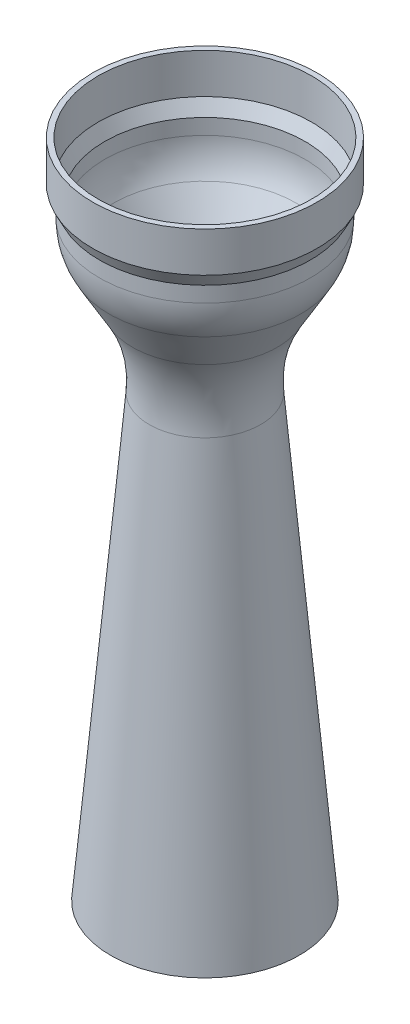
ISO-10303-21;
HEADER;
FILE_DESCRIPTION(('STEP AP214'),'2;1');
FILE_NAME('part.step','',(''),(''),'','','');
FILE_SCHEMA(('AUTOMOTIVE_DESIGN { 1 0 10303 214 1 1 1 1 }'));
ENDSEC;
DATA;
#1=APPLICATION_CONTEXT('core data for automotive mechanical design processes');
#2=APPLICATION_PROTOCOL_DEFINITION('international standard','automotive_design',2000,#1);
#3=PRODUCT_CONTEXT('',#1,'mechanical');
#4=PRODUCT('Part','Part','',(#3));
#5=PRODUCT_RELATED_PRODUCT_CATEGORY('part','',(#4));
#6=PRODUCT_DEFINITION_FORMATION('','',#4);
#7=PRODUCT_DEFINITION_CONTEXT('part definition',#1,'design');
#8=PRODUCT_DEFINITION('design','',#6,#7);
#9=PRODUCT_DEFINITION_SHAPE('','',#8);
#10=(LENGTH_UNIT() NAMED_UNIT(*) SI_UNIT(.MILLI.,.METRE.));
#11=(NAMED_UNIT(*) PLANE_ANGLE_UNIT() SI_UNIT($,.RADIAN.));
#12=(NAMED_UNIT(*) SI_UNIT($,.STERADIAN.) SOLID_ANGLE_UNIT());
#13=UNCERTAINTY_MEASURE_WITH_UNIT(LENGTH_MEASURE(1.E-05),#10,'distance_accuracy_value','');
#14=(GEOMETRIC_REPRESENTATION_CONTEXT(3) GLOBAL_UNCERTAINTY_ASSIGNED_CONTEXT((#13)) GLOBAL_UNIT_ASSIGNED_CONTEXT((#10,
#11,#12)) REPRESENTATION_CONTEXT('',''));
#15=CARTESIAN_POINT('',(0.,0.,0.));
#16=DIRECTION('',(0.,0.,1.));
#17=DIRECTION('',(1.,0.,0.));
#18=AXIS2_PLACEMENT_3D('',#15,#16,#17);
#19=CARTESIAN_POINT('',(0.,2.54000015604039,0.));
#20=DIRECTION('',(0.,1.,0.));
#21=DIRECTION('',(-1.,0.,0.));
#22=AXIS2_PLACEMENT_3D('',#19,#20,#21);
#23=CONICAL_SURFACE('',#22,20.32,0.463647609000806);
#24=CARTESIAN_POINT('',(0.,1.56040388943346E-07,0.));
#25=DIRECTION('',(0.,1.,0.));
#26=DIRECTION('',(-1.,0.,0.));
#27=AXIS2_PLACEMENT_3D('',#24,#25,#26);
#28=CIRCLE('',#27,19.05);
#29=CARTESIAN_POINT('',(-19.05,1.56040386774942E-07,0.));
#30=VERTEX_POINT('',#29);
#31=EDGE_CURVE('E88',#30,#30,#28,.T.);
#32=ORIENTED_EDGE('',*,*,#31,.F.);
#33=EDGE_LOOP('',(#32));
#34=FACE_BOUND('',#33,.T.);
#35=CARTESIAN_POINT('',(0.,2.54000015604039,0.));
#36=DIRECTION('',(0.,1.,0.));
#37=DIRECTION('',(-1.,0.,0.));
#38=AXIS2_PLACEMENT_3D('',#35,#36,#37);
#39=CIRCLE('',#38,20.32);
#40=CARTESIAN_POINT('',(-20.32,2.54000015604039,0.));
#41=VERTEX_POINT('',#40);
#42=EDGE_CURVE('E10',#41,#41,#39,.T.);
#43=ORIENTED_EDGE('',*,*,#42,.T.);
#44=EDGE_LOOP('',(#43));
#45=FACE_BOUND('',#44,.T.);
#46=ADVANCED_FACE('F36',(#34,#45),#23,.F.);
#47=CARTESIAN_POINT('',(0.,0.,0.));
#48=DIRECTION('',(0.,1.,0.));
#49=DIRECTION('',(-1.,0.,0.));
#50=AXIS2_PLACEMENT_3D('',#47,#48,#49);
#51=CYLINDRICAL_SURFACE('',#50,20.32);
#52=ORIENTED_EDGE('',*,*,#42,.F.);
#53=EDGE_LOOP('',(#52));
#54=FACE_BOUND('',#53,.T.);
#55=CARTESIAN_POINT('',(0.,10.1600001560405,0.));
#56=DIRECTION('',(0.,1.,0.));
#57=DIRECTION('',(-1.,0.,0.));
#58=AXIS2_PLACEMENT_3D('',#55,#56,#57);
#59=CIRCLE('',#58,20.32);
#60=CARTESIAN_POINT('',(-20.32,10.1600001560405,0.));
#61=VERTEX_POINT('',#60);
#62=EDGE_CURVE('E42',#61,#61,#59,.T.);
#63=ORIENTED_EDGE('',*,*,#62,.T.);
#64=EDGE_LOOP('',(#63));
#65=FACE_BOUND('',#64,.T.);
#66=ADVANCED_FACE('F95',(#54,#65),#51,.F.);
#67=CARTESIAN_POINT('',(20.32,10.1600001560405,0.));
#68=DIRECTION('',(0.,-1.,0.));
#69=DIRECTION('',(1.,0.,0.));
#70=AXIS2_PLACEMENT_3D('',#67,#68,#69);
#71=PLANE('',#70);
#72=ORIENTED_EDGE('',*,*,#62,.F.);
#73=EDGE_LOOP('',(#72));
#74=FACE_BOUND('',#73,.T.);
#75=CARTESIAN_POINT('',(0.,10.1600001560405,0.));
#76=DIRECTION('',(0.,1.,0.));
#77=DIRECTION('',(-1.,0.,0.));
#78=AXIS2_PLACEMENT_3D('',#75,#76,#77);
#79=CIRCLE('',#78,21.336);
#80=CARTESIAN_POINT('',(-21.336,10.1600001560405,0.));
#81=VERTEX_POINT('',#80);
#82=EDGE_CURVE('E46',#81,#81,#79,.T.);
#83=ORIENTED_EDGE('',*,*,#82,.T.);
#84=EDGE_LOOP('',(#83));
#85=FACE_BOUND('',#84,.T.);
#86=ADVANCED_FACE('F99',(#74,#85),#71,.F.);
#87=CARTESIAN_POINT('',(0.,0.,0.));
#88=DIRECTION('',(0.,1.,0.));
#89=DIRECTION('',(-1.,0.,0.));
#90=AXIS2_PLACEMENT_3D('',#87,#88,#89);
#91=CYLINDRICAL_SURFACE('',#90,21.336);
#92=ORIENTED_EDGE('',*,*,#82,.F.);
#93=EDGE_LOOP('',(#92));
#94=FACE_BOUND('',#93,.T.);
#95=CARTESIAN_POINT('',(0.,2.54,0.));
#96=DIRECTION('',(0.,1.,0.));
#97=DIRECTION('',(-1.,0.,0.));
#98=AXIS2_PLACEMENT_3D('',#95,#96,#97);
#99=CIRCLE('',#98,21.336);
#100=CARTESIAN_POINT('',(-21.336,2.54,0.));
#101=VERTEX_POINT('',#100);
#102=EDGE_CURVE('E50',#101,#101,#99,.T.);
#103=ORIENTED_EDGE('',*,*,#102,.T.);
#104=EDGE_LOOP('',(#103));
#105=FACE_BOUND('',#104,.T.);
#106=ADVANCED_FACE('F104',(#94,#105),#91,.T.);
#107=CARTESIAN_POINT('',(0.,0.,0.));
#108=DIRECTION('',(0.,1.,0.));
#109=DIRECTION('',(-1.,0.,0.));
#110=AXIS2_PLACEMENT_3D('',#107,#108,#109);
#111=CONICAL_SURFACE('',#110,20.066,0.463647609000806);
#112=ORIENTED_EDGE('',*,*,#102,.F.);
#113=EDGE_LOOP('',(#112));
#114=FACE_BOUND('',#113,.T.);
#115=CARTESIAN_POINT('',(0.,0.,0.));
#116=DIRECTION('',(0.,1.,0.));
#117=DIRECTION('',(-1.,0.,0.));
#118=AXIS2_PLACEMENT_3D('',#115,#116,#117);
#119=CIRCLE('',#118,20.066);
#120=CARTESIAN_POINT('',(-20.066,0.,0.));
#121=VERTEX_POINT('',#120);
#122=EDGE_CURVE('E55',#121,#121,#119,.T.);
#123=ORIENTED_EDGE('',*,*,#122,.T.);
#124=EDGE_LOOP('',(#123));
#125=FACE_BOUND('',#124,.T.);
#126=ADVANCED_FACE('F110',(#114,#125),#111,.T.);
#127=CARTESIAN_POINT('',(0.,0.,0.));
#128=DIRECTION('',(0.,1.,0.));
#129=DIRECTION('',(-1.,0.,0.));
#130=AXIS2_PLACEMENT_3D('',#127,#128,#129);
#131=CYLINDRICAL_SURFACE('',#130,20.066);
#132=ORIENTED_EDGE('',*,*,#122,.F.);
#133=EDGE_LOOP('',(#132));
#134=FACE_BOUND('',#133,.T.);
#135=CARTESIAN_POINT('',(0.,-2.94704541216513,0.));
#136=DIRECTION('',(0.,1.,0.));
#137=DIRECTION('',(-1.,0.,0.));
#138=AXIS2_PLACEMENT_3D('',#135,#136,#137);
#139=CIRCLE('',#138,20.066);
#140=CARTESIAN_POINT('',(-20.066,-2.94704541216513,0.));
#141=VERTEX_POINT('',#140);
#142=EDGE_CURVE('E58',#141,#141,#139,.T.);
#143=ORIENTED_EDGE('',*,*,#142,.T.);
#144=EDGE_LOOP('',(#143));
#145=FACE_BOUND('',#144,.T.);
#146=ADVANCED_FACE('F114',(#134,#145),#131,.T.);
#147=CARTESIAN_POINT('',(0.,-2.94704525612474,0.));
#148=DIRECTION('',(0.,1.,0.));
#149=DIRECTION('',(-1.,0.,0.));
#150=AXIS2_PLACEMENT_3D('',#147,#148,#149);
#151=DEGENERATE_TOROIDAL_SURFACE('',#150,6.35,13.716,.T.);
#152=ORIENTED_EDGE('',*,*,#142,.F.);
#153=EDGE_LOOP('',(#152));
#154=FACE_BOUND('',#153,.T.);
#155=CARTESIAN_POINT('',(0.,-9.80504498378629,0.));
#156=DIRECTION('',(0.,1.,0.));
#157=DIRECTION('',(-1.,0.,0.));
#158=AXIS2_PLACEMENT_3D('',#155,#156,#157);
#159=CIRCLE('',#158,18.228404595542);
#160=CARTESIAN_POINT('',(-18.228404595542,-9.80504498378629,0.));
#161=VERTEX_POINT('',#160);
#162=EDGE_CURVE('E61',#161,#161,#159,.T.);
#163=ORIENTED_EDGE('',*,*,#162,.T.);
#164=EDGE_LOOP('',(#163));
#165=FACE_BOUND('',#164,.T.);
#166=ADVANCED_FACE('F118',(#154,#165),#151,.T.);
#167=CARTESIAN_POINT('',(0.,-17.5056884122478,0.));
#168=DIRECTION('',(0.,1.,0.));
#169=DIRECTION('',(-1.,0.,0.));
#170=AXIS2_PLACEMENT_3D('',#167,#168,#169);
#171=CONICAL_SURFACE('',#170,13.7824362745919,0.523598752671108);
#172=ORIENTED_EDGE('',*,*,#162,.F.);
#173=EDGE_LOOP('',(#172));
#174=FACE_BOUND('',#173,.T.);
#175=CARTESIAN_POINT('',(0.,-17.5056884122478,0.));
#176=DIRECTION('',(0.,1.,0.));
#177=DIRECTION('',(-1.,0.,0.));
#178=AXIS2_PLACEMENT_3D('',#175,#176,#177);
#179=CIRCLE('',#178,13.7824362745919);
#180=CARTESIAN_POINT('',(-13.7824362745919,-17.5056884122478,0.));
#181=VERTEX_POINT('',#180);
#182=EDGE_CURVE('E64',#181,#181,#179,.T.);
#183=ORIENTED_EDGE('',*,*,#182,.T.);
#184=EDGE_LOOP('',(#183));
#185=FACE_BOUND('',#184,.T.);
#186=ADVANCED_FACE('F122',(#174,#185),#171,.T.);
#187=CARTESIAN_POINT('',(0.,-29.6976879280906,0.));
#188=DIRECTION('',(0.,1.,0.));
#189=DIRECTION('',(-1.,0.,0.));
#190=AXIS2_PLACEMENT_3D('',#187,#188,#189);
#191=TOROIDAL_SURFACE('',#190,34.8996,24.384);
#192=ORIENTED_EDGE('',*,*,#182,.F.);
#193=EDGE_LOOP('',(#192));
#194=FACE_BOUND('',#193,.T.);
#195=CARTESIAN_POINT('',(0.,-31.8228935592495,0.));
#196=DIRECTION('',(0.,1.,0.));
#197=DIRECTION('',(-1.,0.,0.));
#198=AXIS2_PLACEMENT_3D('',#195,#196,#197);
#199=CIRCLE('',#198,10.6083884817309);
#200=CARTESIAN_POINT('',(-10.6083884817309,-31.8228935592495,0.));
#201=VERTEX_POINT('',#200);
#202=EDGE_CURVE('E67',#201,#201,#199,.T.);
#203=ORIENTED_EDGE('',*,*,#202,.T.);
#204=EDGE_LOOP('',(#203));
#205=FACE_BOUND('',#204,.T.);
#206=ADVANCED_FACE('F126',(#194,#205),#191,.F.);
#207=CARTESIAN_POINT('',(0.,-115.60025556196,0.));
#208=DIRECTION('',(0.,-1.,0.));
#209=DIRECTION('',(1.,0.,0.));
#210=AXIS2_PLACEMENT_3D('',#207,#208,#209);
#211=CONICAL_SURFACE('',#210,17.9379579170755,0.0872664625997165);
#212=ORIENTED_EDGE('',*,*,#202,.F.);
#213=EDGE_LOOP('',(#212));
#214=FACE_BOUND('',#213,.T.);
#215=CARTESIAN_POINT('',(0.,-115.60025556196,0.));
#216=DIRECTION('',(0.,1.,0.));
#217=DIRECTION('',(-1.,0.,0.));
#218=AXIS2_PLACEMENT_3D('',#215,#216,#217);
#219=CIRCLE('',#218,17.9379579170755);
#220=CARTESIAN_POINT('',(-17.9379579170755,-115.60025556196,0.));
#221=VERTEX_POINT('',#220);
#222=EDGE_CURVE('E70',#221,#221,#219,.T.);
#223=ORIENTED_EDGE('',*,*,#222,.T.);
#224=EDGE_LOOP('',(#223));
#225=FACE_BOUND('',#224,.T.);
#226=ADVANCED_FACE('F130',(#214,#225),#211,.T.);
#227=CARTESIAN_POINT('',(17.9379579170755,-115.60025556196,0.));
#228=DIRECTION('',(0.,1.,0.));
#229=DIRECTION('',(-1.,0.,0.));
#230=AXIS2_PLACEMENT_3D('',#227,#228,#229);
#231=PLANE('',#230);
#232=ORIENTED_EDGE('',*,*,#222,.F.);
#233=EDGE_LOOP('',(#232));
#234=FACE_BOUND('',#233,.T.);
#235=CARTESIAN_POINT('',(0.,-115.60025556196,0.));
#236=DIRECTION('',(0.,1.,0.));
#237=DIRECTION('',(-1.,0.,0.));
#238=AXIS2_PLACEMENT_3D('',#235,#236,#237);
#239=CIRCLE('',#238,16.9180769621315);
#240=CARTESIAN_POINT('',(-16.9180769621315,-115.60025556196,0.));
#241=VERTEX_POINT('',#240);
#242=EDGE_CURVE('E73',#241,#241,#239,.T.);
#243=ORIENTED_EDGE('',*,*,#242,.T.);
#244=EDGE_LOOP('',(#243));
#245=FACE_BOUND('',#244,.T.);
#246=ADVANCED_FACE('F134',(#234,#245),#231,.F.);
#247=CARTESIAN_POINT('',(0.,-31.9114437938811,0.));
#248=DIRECTION('',(0.,-1.,0.));
#249=DIRECTION('',(1.,0.,0.));
#250=AXIS2_PLACEMENT_3D('',#247,#248,#249);
#251=CONICAL_SURFACE('',#250,9.59625466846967,0.0872664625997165);
#252=ORIENTED_EDGE('',*,*,#242,.F.);
#253=EDGE_LOOP('',(#252));
#254=FACE_BOUND('',#253,.T.);
#255=CARTESIAN_POINT('',(0.,-31.9114437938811,0.));
#256=DIRECTION('',(0.,1.,0.));
#257=DIRECTION('',(-1.,0.,0.));
#258=AXIS2_PLACEMENT_3D('',#255,#256,#257);
#259=CIRCLE('',#258,9.59625466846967);
#260=CARTESIAN_POINT('',(-9.59625466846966,-31.9114437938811,0.));
#261=VERTEX_POINT('',#260);
#262=EDGE_CURVE('E76',#261,#261,#259,.T.);
#263=ORIENTED_EDGE('',*,*,#262,.T.);
#264=EDGE_LOOP('',(#263));
#265=FACE_BOUND('',#264,.T.);
#266=ADVANCED_FACE('F138',(#254,#265),#251,.F.);
#267=CARTESIAN_POINT('',(0.,-29.6976879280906,0.));
#268=DIRECTION('',(0.,1.,0.));
#269=DIRECTION('',(-1.,0.,0.));
#270=AXIS2_PLACEMENT_3D('',#267,#268,#269);
#271=TOROIDAL_SURFACE('',#270,34.8996,25.4);
#272=ORIENTED_EDGE('',*,*,#262,.F.);
#273=EDGE_LOOP('',(#272));
#274=FACE_BOUND('',#273,.T.);
#275=CARTESIAN_POINT('',(0.,-16.9976884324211,0.));
#276=DIRECTION('',(0.,1.,0.));
#277=DIRECTION('',(-1.,0.,0.));
#278=AXIS2_PLACEMENT_3D('',#275,#276,#277);
#279=CIRCLE('',#278,12.9025544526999);
#280=CARTESIAN_POINT('',(-12.9025544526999,-16.9976884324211,0.));
#281=VERTEX_POINT('',#280);
#282=EDGE_CURVE('E79',#281,#281,#279,.T.);
#283=ORIENTED_EDGE('',*,*,#282,.T.);
#284=EDGE_LOOP('',(#283));
#285=FACE_BOUND('',#284,.T.);
#286=ADVANCED_FACE('F142',(#274,#285),#271,.T.);
#287=CARTESIAN_POINT('',(0.,-9.29704500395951,0.));
#288=DIRECTION('',(0.,1.,0.));
#289=DIRECTION('',(-1.,0.,0.));
#290=AXIS2_PLACEMENT_3D('',#287,#288,#289);
#291=CONICAL_SURFACE('',#290,17.34852277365,0.523598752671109);
#292=ORIENTED_EDGE('',*,*,#282,.F.);
#293=EDGE_LOOP('',(#292));
#294=FACE_BOUND('',#293,.T.);
#295=CARTESIAN_POINT('',(0.,-9.29704500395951,0.));
#296=DIRECTION('',(0.,1.,0.));
#297=DIRECTION('',(-1.,0.,0.));
#298=AXIS2_PLACEMENT_3D('',#295,#296,#297);
#299=CIRCLE('',#298,17.34852277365);
#300=CARTESIAN_POINT('',(-17.34852277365,-9.29704500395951,0.));
#301=VERTEX_POINT('',#300);
#302=EDGE_CURVE('E82',#301,#301,#299,.T.);
#303=ORIENTED_EDGE('',*,*,#302,.T.);
#304=EDGE_LOOP('',(#303));
#305=FACE_BOUND('',#304,.T.);
#306=ADVANCED_FACE('F146',(#294,#305),#291,.F.);
#307=CARTESIAN_POINT('',(0.,-2.94704525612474,0.));
#308=DIRECTION('',(0.,1.,0.));
#309=DIRECTION('',(-1.,0.,0.));
#310=AXIS2_PLACEMENT_3D('',#307,#308,#309);
#311=DEGENERATE_TOROIDAL_SURFACE('',#310,6.35,12.7,.T.);
#312=ORIENTED_EDGE('',*,*,#302,.F.);
#313=EDGE_LOOP('',(#312));
#314=FACE_BOUND('',#313,.T.);
#315=CARTESIAN_POINT('',(0.,-2.94704525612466,0.));
#316=DIRECTION('',(0.,1.,0.));
#317=DIRECTION('',(-1.,0.,0.));
#318=AXIS2_PLACEMENT_3D('',#315,#316,#317);
#319=CIRCLE('',#318,19.05);
#320=CARTESIAN_POINT('',(-19.05,-2.94704525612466,0.));
#321=VERTEX_POINT('',#320);
#322=EDGE_CURVE('E85',#321,#321,#319,.T.);
#323=ORIENTED_EDGE('',*,*,#322,.T.);
#324=EDGE_LOOP('',(#323));
#325=FACE_BOUND('',#324,.T.);
#326=ADVANCED_FACE('F150',(#314,#325),#311,.F.);
#327=CARTESIAN_POINT('',(0.,0.,0.));
#328=DIRECTION('',(0.,1.,0.));
#329=DIRECTION('',(-1.,0.,0.));
#330=AXIS2_PLACEMENT_3D('',#327,#328,#329);
#331=CYLINDRICAL_SURFACE('',#330,19.05);
#332=ORIENTED_EDGE('',*,*,#322,.F.);
#333=EDGE_LOOP('',(#332));
#334=FACE_BOUND('',#333,.T.);
#335=ORIENTED_EDGE('',*,*,#31,.T.);
#336=EDGE_LOOP('',(#335));
#337=FACE_BOUND('',#336,.T.);
#338=ADVANCED_FACE('F92',(#334,#337),#331,.F.);
#339=CLOSED_SHELL('',(#46,#66,#86,#106,#126,#146,#166,#186,#206,#226,#246,#266,#286,#306,#326,#338));
#340=MANIFOLD_SOLID_BREP('B2',#339);
#341=ADVANCED_BREP_SHAPE_REPRESENTATION('',(#18,#340),#14);
#342=SHAPE_DEFINITION_REPRESENTATION(#9,#341);
ENDSEC;
END-ISO-10303-21;
